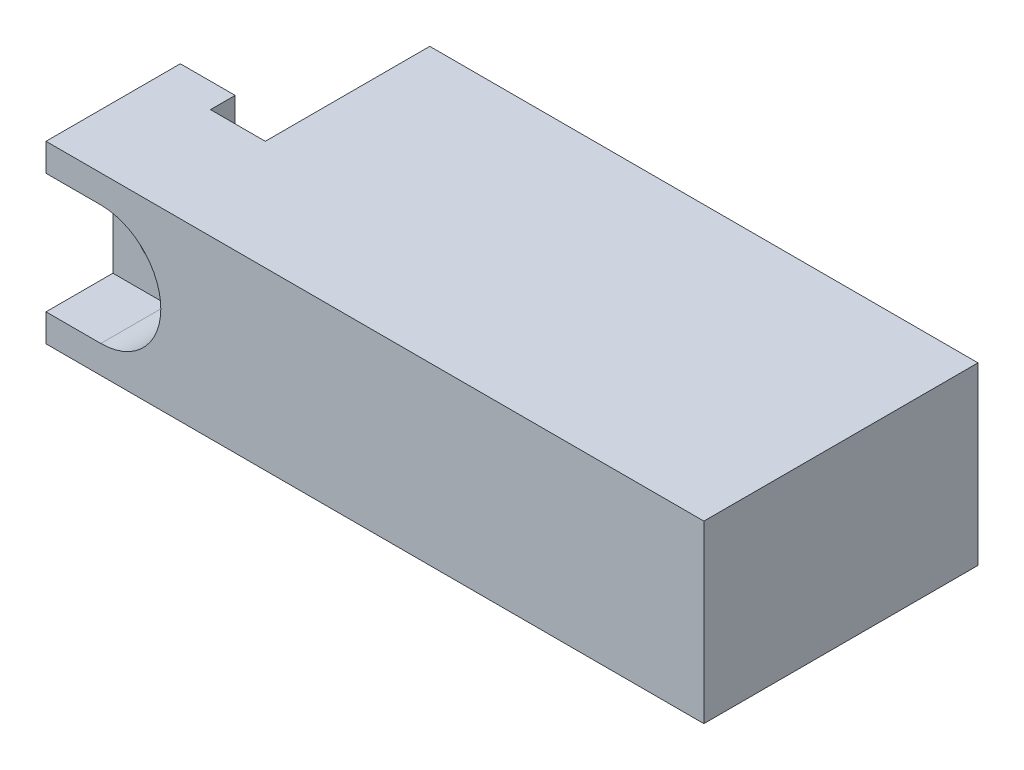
ISO-10303-21;
HEADER;
FILE_DESCRIPTION(('STEP AP214'),'2;1');
FILE_NAME('part.step','',(''),(''),'','','');
FILE_SCHEMA(('AUTOMOTIVE_DESIGN { 1 0 10303 214 1 1 1 1 }'));
ENDSEC;
DATA;
#1=APPLICATION_CONTEXT('core data for automotive mechanical design processes');
#2=APPLICATION_PROTOCOL_DEFINITION('international standard','automotive_design',2000,#1);
#3=PRODUCT_CONTEXT('',#1,'mechanical');
#4=PRODUCT('Part','Part','',(#3));
#5=PRODUCT_RELATED_PRODUCT_CATEGORY('part','',(#4));
#6=PRODUCT_DEFINITION_FORMATION('','',#4);
#7=PRODUCT_DEFINITION_CONTEXT('part definition',#1,'design');
#8=PRODUCT_DEFINITION('design','',#6,#7);
#9=PRODUCT_DEFINITION_SHAPE('','',#8);
#10=(LENGTH_UNIT() NAMED_UNIT(*) SI_UNIT(.MILLI.,.METRE.));
#11=(NAMED_UNIT(*) PLANE_ANGLE_UNIT() SI_UNIT($,.RADIAN.));
#12=(NAMED_UNIT(*) SI_UNIT($,.STERADIAN.) SOLID_ANGLE_UNIT());
#13=UNCERTAINTY_MEASURE_WITH_UNIT(LENGTH_MEASURE(1.E-05),#10,'distance_accuracy_value','');
#14=(GEOMETRIC_REPRESENTATION_CONTEXT(3) GLOBAL_UNCERTAINTY_ASSIGNED_CONTEXT((#13)) GLOBAL_UNIT_ASSIGNED_CONTEXT((#10,
#11,#12)) REPRESENTATION_CONTEXT('',''));
#15=CARTESIAN_POINT('',(0.,0.,0.));
#16=DIRECTION('',(0.,0.,1.));
#17=DIRECTION('',(1.,0.,0.));
#18=AXIS2_PLACEMENT_3D('',#15,#16,#17);
#19=CARTESIAN_POINT('',(-2.54,4.064,-6.35));
#20=DIRECTION('',(-1.,0.,0.));
#21=DIRECTION('',(0.,0.,1.));
#22=AXIS2_PLACEMENT_3D('',#19,#20,#21);
#23=PLANE('',#22);
#24=DIRECTION('',(0.,-1.,0.));
#25=VECTOR('',#24,1.);
#26=CARTESIAN_POINT('',(-2.54,-1.63195,-6.223));
#27=LINE('',#26,#25);
#28=CARTESIAN_POINT('',(-2.54,-1.63195,-6.223));
#29=VERTEX_POINT('',#28);
#30=CARTESIAN_POINT('',(-2.54,-4.064,-6.223));
#31=VERTEX_POINT('',#30);
#32=EDGE_CURVE('E258',#29,#31,#27,.T.);
#33=ORIENTED_EDGE('',*,*,#32,.F.);
#34=DIRECTION('',(0.,0.,1.));
#35=VECTOR('',#34,1.);
#36=CARTESIAN_POINT('',(-2.53999999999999,-1.63195,0.));
#37=LINE('',#36,#35);
#38=CARTESIAN_POINT('',(-2.54,-1.63195,-5.08));
#39=VERTEX_POINT('',#38);
#40=EDGE_CURVE('E199',#29,#39,#37,.T.);
#41=ORIENTED_EDGE('',*,*,#40,.T.);
#42=DIRECTION('',(0.,-1.,0.));
#43=VECTOR('',#42,1.);
#44=CARTESIAN_POINT('',(-2.54,4.064,-5.08));
#45=LINE('',#44,#43);
#46=CARTESIAN_POINT('',(-2.54,-4.064,-5.08));
#47=VERTEX_POINT('',#46);
#48=EDGE_CURVE('E156',#39,#47,#45,.T.);
#49=ORIENTED_EDGE('',*,*,#48,.T.);
#50=DIRECTION('',(0.,0.,-1.));
#51=VECTOR('',#50,1.);
#52=CARTESIAN_POINT('',(-2.54,-4.064,-6.35));
#53=LINE('',#52,#51);
#54=EDGE_CURVE('E178',#47,#31,#53,.T.);
#55=ORIENTED_EDGE('',*,*,#54,.T.);
#56=EDGE_LOOP('',(#33,#41,#49,#55));
#57=FACE_BOUND('',#56,.T.);
#58=ADVANCED_FACE('F37',(#57),#23,.F.);
#59=CARTESIAN_POINT('',(-5.08,4.064,-6.35));
#60=DIRECTION('',(1.,0.,0.));
#61=DIRECTION('',(0.,0.,-1.));
#62=AXIS2_PLACEMENT_3D('',#59,#60,#61);
#63=PLANE('',#62);
#64=DIRECTION('',(0.,1.,0.));
#65=VECTOR('',#64,1.);
#66=CARTESIAN_POINT('',(-5.08,-4.064,-6.223));
#67=LINE('',#66,#65);
#68=CARTESIAN_POINT('',(-5.08,-4.064,-6.223));
#69=VERTEX_POINT('',#68);
#70=CARTESIAN_POINT('',(-5.08,4.064,-6.223));
#71=VERTEX_POINT('',#70);
#72=EDGE_CURVE('E138',#69,#71,#67,.T.);
#73=ORIENTED_EDGE('',*,*,#72,.F.);
#74=DIRECTION('',(0.,0.,1.));
#75=VECTOR('',#74,1.);
#76=CARTESIAN_POINT('',(-5.08,-4.064,-6.35));
#77=LINE('',#76,#75);
#78=CARTESIAN_POINT('',(-5.08,-4.064,0.));
#79=VERTEX_POINT('',#78);
#80=EDGE_CURVE('E164',#69,#79,#77,.T.);
#81=ORIENTED_EDGE('',*,*,#80,.T.);
#82=DIRECTION('',(0.,-1.,0.));
#83=VECTOR('',#82,1.);
#84=CARTESIAN_POINT('',(-5.08,4.064,0.));
#85=LINE('',#84,#83);
#86=CARTESIAN_POINT('',(-5.08,-2.77876,0.));
#87=VERTEX_POINT('',#86);
#88=EDGE_CURVE('E194',#87,#79,#85,.T.);
#89=ORIENTED_EDGE('',*,*,#88,.F.);
#90=DIRECTION('',(0.,0.,1.));
#91=VECTOR('',#90,1.);
#92=CARTESIAN_POINT('',(-5.08,-2.77876,-9.20925240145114));
#93=LINE('',#92,#91);
#94=CARTESIAN_POINT('',(-5.08,-2.77876,-3.0988));
#95=VERTEX_POINT('',#94);
#96=EDGE_CURVE('E222',#95,#87,#93,.T.);
#97=ORIENTED_EDGE('',*,*,#96,.F.);
#98=DIRECTION('',(0.,1.,0.));
#99=VECTOR('',#98,1.);
#100=CARTESIAN_POINT('',(-5.08,4.064,-3.0988));
#101=LINE('',#100,#99);
#102=CARTESIAN_POINT('',(-5.08,2.77876,-3.0988));
#103=VERTEX_POINT('',#102);
#104=EDGE_CURVE('E11',#95,#103,#101,.T.);
#105=ORIENTED_EDGE('',*,*,#104,.T.);
#106=DIRECTION('',(0.,0.,1.));
#107=VECTOR('',#106,1.);
#108=CARTESIAN_POINT('',(-5.08,2.77876,-9.20925240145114));
#109=LINE('',#108,#107);
#110=CARTESIAN_POINT('',(-5.08,2.77876,0.));
#111=VERTEX_POINT('',#110);
#112=EDGE_CURVE('E227',#103,#111,#109,.T.);
#113=ORIENTED_EDGE('',*,*,#112,.T.);
#114=CARTESIAN_POINT('',(-5.08,4.064,0.));
#115=VERTEX_POINT('',#114);
#116=EDGE_CURVE('E195',#115,#111,#85,.T.);
#117=ORIENTED_EDGE('',*,*,#116,.F.);
#118=DIRECTION('',(0.,0.,1.));
#119=VECTOR('',#118,1.);
#120=CARTESIAN_POINT('',(-5.08,4.064,-6.35));
#121=LINE('',#120,#119);
#122=EDGE_CURVE('E180',#71,#115,#121,.T.);
#123=ORIENTED_EDGE('',*,*,#122,.F.);
#124=EDGE_LOOP('',(#73,#81,#89,#97,#105,#113,#117,#123));
#125=FACE_BOUND('',#124,.T.);
#126=ADVANCED_FACE('F39',(#125),#63,.F.);
#127=DIRECTION('',(0.,-1.,0.));
#128=VECTOR('',#127,1.);
#129=CARTESIAN_POINT('',(-2.54,4.064,-6.223));
#130=LINE('',#129,#128);
#131=CARTESIAN_POINT('',(-2.54,4.064,-6.223));
#132=VERTEX_POINT('',#131);
#133=CARTESIAN_POINT('',(-2.53999999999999,1.63195,-6.223));
#134=VERTEX_POINT('',#133);
#135=EDGE_CURVE('E52',#132,#134,#130,.T.);
#136=ORIENTED_EDGE('',*,*,#135,.F.);
#137=DIRECTION('',(0.,0.,-1.));
#138=VECTOR('',#137,1.);
#139=CARTESIAN_POINT('',(-2.54,4.064,-6.35));
#140=LINE('',#139,#138);
#141=CARTESIAN_POINT('',(-2.54,4.064,-5.08));
#142=VERTEX_POINT('',#141);
#143=EDGE_CURVE('E148',#142,#132,#140,.T.);
#144=ORIENTED_EDGE('',*,*,#143,.F.);
#145=CARTESIAN_POINT('',(-2.53999999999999,1.63195,-5.08));
#146=VERTEX_POINT('',#145);
#147=EDGE_CURVE('E158',#142,#146,#45,.T.);
#148=ORIENTED_EDGE('',*,*,#147,.T.);
#149=DIRECTION('',(0.,0.,1.));
#150=VECTOR('',#149,1.);
#151=CARTESIAN_POINT('',(-2.53999999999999,1.63195,0.));
#152=LINE('',#151,#150);
#153=EDGE_CURVE('E149',#146,#134,#152,.F.);
#154=ORIENTED_EDGE('',*,*,#153,.T.);
#155=EDGE_LOOP('',(#136,#144,#148,#154));
#156=FACE_BOUND('',#155,.T.);
#157=ADVANCED_FACE('F146',(#156),#23,.F.);
#158=CARTESIAN_POINT('',(-5.08,4.064,-6.35));
#159=DIRECTION('',(0.,-1.,0.));
#160=DIRECTION('',(0.,0.,-1.));
#161=AXIS2_PLACEMENT_3D('',#158,#159,#160);
#162=PLANE('',#161);
#163=DIRECTION('',(1.,0.,0.));
#164=VECTOR('',#163,1.);
#165=CARTESIAN_POINT('',(-5.08,4.064,-6.223));
#166=LINE('',#165,#164);
#167=EDGE_CURVE('E135',#71,#132,#166,.T.);
#168=ORIENTED_EDGE('',*,*,#167,.F.);
#169=ORIENTED_EDGE('',*,*,#122,.T.);
#170=DIRECTION('',(1.,0.,0.));
#171=VECTOR('',#170,1.);
#172=CARTESIAN_POINT('',(-5.08,4.064,0.));
#173=LINE('',#172,#171);
#174=CARTESIAN_POINT('',(25.4,4.064,0.));
#175=VERTEX_POINT('',#174);
#176=EDGE_CURVE('E237',#115,#175,#173,.T.);
#177=ORIENTED_EDGE('',*,*,#176,.T.);
#178=DIRECTION('',(0.,0.,-1.));
#179=VECTOR('',#178,1.);
#180=CARTESIAN_POINT('',(25.4,4.064,-12.7));
#181=LINE('',#180,#179);
#182=CARTESIAN_POINT('',(25.4,4.064,-12.7));
#183=VERTEX_POINT('',#182);
#184=EDGE_CURVE('E239',#175,#183,#181,.T.);
#185=ORIENTED_EDGE('',*,*,#184,.T.);
#186=DIRECTION('',(-1.,0.,0.));
#187=VECTOR('',#186,1.);
#188=CARTESIAN_POINT('',(0.,4.064,-12.7));
#189=LINE('',#188,#187);
#190=CARTESIAN_POINT('',(0.,4.064,-12.7));
#191=VERTEX_POINT('',#190);
#192=EDGE_CURVE('E241',#183,#191,#189,.T.);
#193=ORIENTED_EDGE('',*,*,#192,.T.);
#194=DIRECTION('',(0.,0.,1.));
#195=VECTOR('',#194,1.);
#196=CARTESIAN_POINT('',(0.,4.064,-5.08));
#197=LINE('',#196,#195);
#198=CARTESIAN_POINT('',(0.,4.064,-5.08));
#199=VERTEX_POINT('',#198);
#200=EDGE_CURVE('E160',#191,#199,#197,.T.);
#201=ORIENTED_EDGE('',*,*,#200,.T.);
#202=DIRECTION('',(-1.,0.,0.));
#203=VECTOR('',#202,1.);
#204=CARTESIAN_POINT('',(-2.54,4.064,-5.08));
#205=LINE('',#204,#203);
#206=EDGE_CURVE('E154',#199,#142,#205,.T.);
#207=ORIENTED_EDGE('',*,*,#206,.T.);
#208=ORIENTED_EDGE('',*,*,#143,.T.);
#209=EDGE_LOOP('',(#168,#169,#177,#185,#193,#201,#207,#208));
#210=FACE_BOUND('',#209,.T.);
#211=ADVANCED_FACE('F152',(#210),#162,.F.);
#212=CARTESIAN_POINT('',(-5.08,-4.064,-6.35));
#213=DIRECTION('',(0.,-1.,0.));
#214=DIRECTION('',(0.,0.,-1.));
#215=AXIS2_PLACEMENT_3D('',#212,#213,#214);
#216=PLANE('',#215);
#217=ORIENTED_EDGE('',*,*,#80,.F.);
#218=DIRECTION('',(-1.,0.,0.));
#219=VECTOR('',#218,1.);
#220=CARTESIAN_POINT('',(-2.54,-4.064,-6.223));
#221=LINE('',#220,#219);
#222=EDGE_CURVE('E260',#31,#69,#221,.T.);
#223=ORIENTED_EDGE('',*,*,#222,.F.);
#224=ORIENTED_EDGE('',*,*,#54,.F.);
#225=DIRECTION('',(-1.,0.,0.));
#226=VECTOR('',#225,1.);
#227=CARTESIAN_POINT('',(-2.54,-4.064,-5.08));
#228=LINE('',#227,#226);
#229=CARTESIAN_POINT('',(0.,-4.064,-5.08));
#230=VERTEX_POINT('',#229);
#231=EDGE_CURVE('E175',#230,#47,#228,.T.);
#232=ORIENTED_EDGE('',*,*,#231,.F.);
#233=DIRECTION('',(0.,0.,1.));
#234=VECTOR('',#233,1.);
#235=CARTESIAN_POINT('',(0.,-4.064,-5.08));
#236=LINE('',#235,#234);
#237=CARTESIAN_POINT('',(0.,-4.064,-12.7));
#238=VERTEX_POINT('',#237);
#239=EDGE_CURVE('E173',#238,#230,#236,.T.);
#240=ORIENTED_EDGE('',*,*,#239,.F.);
#241=DIRECTION('',(-1.,0.,0.));
#242=VECTOR('',#241,1.);
#243=CARTESIAN_POINT('',(0.,-4.064,-12.7));
#244=LINE('',#243,#242);
#245=CARTESIAN_POINT('',(25.4,-4.064,-12.7));
#246=VERTEX_POINT('',#245);
#247=EDGE_CURVE('E171',#246,#238,#244,.T.);
#248=ORIENTED_EDGE('',*,*,#247,.F.);
#249=DIRECTION('',(0.,0.,-1.));
#250=VECTOR('',#249,1.);
#251=CARTESIAN_POINT('',(25.4,-4.064,-12.7));
#252=LINE('',#251,#250);
#253=CARTESIAN_POINT('',(25.4,-4.064,0.));
#254=VERTEX_POINT('',#253);
#255=EDGE_CURVE('E169',#254,#246,#252,.T.);
#256=ORIENTED_EDGE('',*,*,#255,.F.);
#257=DIRECTION('',(1.,0.,0.));
#258=VECTOR('',#257,1.);
#259=CARTESIAN_POINT('',(-5.08,-4.064,0.));
#260=LINE('',#259,#258);
#261=EDGE_CURVE('E166',#79,#254,#260,.T.);
#262=ORIENTED_EDGE('',*,*,#261,.F.);
#263=EDGE_LOOP('',(#217,#223,#224,#232,#240,#248,#256,#262));
#264=FACE_BOUND('',#263,.T.);
#265=ADVANCED_FACE('F283',(#264),#216,.T.);
#266=CARTESIAN_POINT('',(-2.54,0.,0.));
#267=DIRECTION('',(0.,0.,1.));
#268=DIRECTION('',(1.,0.,0.));
#269=AXIS2_PLACEMENT_3D('',#266,#267,#268);
#270=CYLINDRICAL_SURFACE('',#269,1.63195);
#271=CARTESIAN_POINT('',(-2.54,0.,-3.0988));
#272=DIRECTION('',(0.,0.,1.));
#273=DIRECTION('',(1.,0.,0.));
#274=AXIS2_PLACEMENT_3D('',#271,#272,#273);
#275=CIRCLE('',#274,1.63195);
#276=CARTESIAN_POINT('',(-0.90805,0.,-3.0988));
#277=VERTEX_POINT('',#276);
#278=EDGE_CURVE('E220',#277,#277,#275,.T.);
#279=ORIENTED_EDGE('',*,*,#278,.T.);
#280=EDGE_LOOP('',(#279));
#281=FACE_BOUND('',#280,.T.);
#282=CARTESIAN_POINT('',(-2.54,0.,-6.223));
#283=DIRECTION('',(0.,0.,1.));
#284=DIRECTION('',(-1.,0.,0.));
#285=AXIS2_PLACEMENT_3D('',#282,#283,#284);
#286=CIRCLE('',#285,1.63195);
#287=EDGE_CURVE('E150',#134,#29,#286,.T.);
#288=ORIENTED_EDGE('',*,*,#287,.F.);
#289=ORIENTED_EDGE('',*,*,#153,.F.);
#290=CARTESIAN_POINT('',(-2.54,0.,-5.08));
#291=DIRECTION('',(0.,0.,1.));
#292=DIRECTION('',(1.,0.,0.));
#293=AXIS2_PLACEMENT_3D('',#290,#291,#292);
#294=CIRCLE('',#293,1.63195);
#295=EDGE_CURVE('E167',#39,#146,#294,.T.);
#296=ORIENTED_EDGE('',*,*,#295,.F.);
#297=ORIENTED_EDGE('',*,*,#40,.F.);
#298=EDGE_LOOP('',(#288,#289,#296,#297));
#299=FACE_BOUND('',#298,.T.);
#300=ADVANCED_FACE('F256',(#281,#299),#270,.F.);
#301=CARTESIAN_POINT('',(-5.08,4.064,0.));
#302=DIRECTION('',(0.,0.,-1.));
#303=DIRECTION('',(-1.,0.,0.));
#304=AXIS2_PLACEMENT_3D('',#301,#302,#303);
#305=PLANE('',#304);
#306=ORIENTED_EDGE('',*,*,#116,.T.);
#307=DIRECTION('',(-1.,0.,0.));
#308=VECTOR('',#307,1.);
#309=CARTESIAN_POINT('',(-2.54,2.77876,0.));
#310=LINE('',#309,#308);
#311=CARTESIAN_POINT('',(-2.54,2.77876,0.));
#312=VERTEX_POINT('',#311);
#313=EDGE_CURVE('E207',#312,#111,#310,.T.);
#314=ORIENTED_EDGE('',*,*,#313,.F.);
#315=CARTESIAN_POINT('',(-2.54,0.,0.));
#316=DIRECTION('',(0.,0.,-1.));
#317=DIRECTION('',(-1.,0.,0.));
#318=AXIS2_PLACEMENT_3D('',#315,#316,#317);
#319=CIRCLE('',#318,2.77876);
#320=CARTESIAN_POINT('',(-2.54,-2.77876,0.));
#321=VERTEX_POINT('',#320);
#322=EDGE_CURVE('E45',#312,#321,#319,.T.);
#323=ORIENTED_EDGE('',*,*,#322,.T.);
#324=DIRECTION('',(1.,0.,0.));
#325=VECTOR('',#324,1.);
#326=CARTESIAN_POINT('',(-2.54,-2.77876,0.));
#327=LINE('',#326,#325);
#328=EDGE_CURVE('E60',#87,#321,#327,.T.);
#329=ORIENTED_EDGE('',*,*,#328,.F.);
#330=ORIENTED_EDGE('',*,*,#88,.T.);
#331=ORIENTED_EDGE('',*,*,#261,.T.);
#332=DIRECTION('',(0.,-1.,0.));
#333=VECTOR('',#332,1.);
#334=CARTESIAN_POINT('',(25.4,4.064,0.));
#335=LINE('',#334,#333);
#336=EDGE_CURVE('E191',#175,#254,#335,.T.);
#337=ORIENTED_EDGE('',*,*,#336,.F.);
#338=ORIENTED_EDGE('',*,*,#176,.F.);
#339=EDGE_LOOP('',(#306,#314,#323,#329,#330,#331,#337,#338));
#340=FACE_BOUND('',#339,.T.);
#341=ADVANCED_FACE('F204',(#340),#305,.F.);
#342=CARTESIAN_POINT('',(25.4,4.064,-12.7));
#343=DIRECTION('',(-1.,0.,0.));
#344=DIRECTION('',(0.,0.,1.));
#345=AXIS2_PLACEMENT_3D('',#342,#343,#344);
#346=PLANE('',#345);
#347=ORIENTED_EDGE('',*,*,#255,.T.);
#348=DIRECTION('',(0.,-1.,0.));
#349=VECTOR('',#348,1.);
#350=CARTESIAN_POINT('',(25.4,4.064,-12.7));
#351=LINE('',#350,#349);
#352=EDGE_CURVE('E188',#183,#246,#351,.T.);
#353=ORIENTED_EDGE('',*,*,#352,.F.);
#354=ORIENTED_EDGE('',*,*,#184,.F.);
#355=ORIENTED_EDGE('',*,*,#336,.T.);
#356=EDGE_LOOP('',(#347,#353,#354,#355));
#357=FACE_BOUND('',#356,.T.);
#358=ADVANCED_FACE('F288',(#357),#346,.F.);
#359=CARTESIAN_POINT('',(0.,4.064,-12.7));
#360=DIRECTION('',(0.,0.,1.));
#361=DIRECTION('',(1.,0.,0.));
#362=AXIS2_PLACEMENT_3D('',#359,#360,#361);
#363=PLANE('',#362);
#364=ORIENTED_EDGE('',*,*,#247,.T.);
#365=DIRECTION('',(0.,-1.,0.));
#366=VECTOR('',#365,1.);
#367=CARTESIAN_POINT('',(0.,4.064,-12.7));
#368=LINE('',#367,#366);
#369=EDGE_CURVE('E185',#191,#238,#368,.T.);
#370=ORIENTED_EDGE('',*,*,#369,.F.);
#371=ORIENTED_EDGE('',*,*,#192,.F.);
#372=ORIENTED_EDGE('',*,*,#352,.T.);
#373=EDGE_LOOP('',(#364,#370,#371,#372));
#374=FACE_BOUND('',#373,.T.);
#375=ADVANCED_FACE('F290',(#374),#363,.F.);
#376=CARTESIAN_POINT('',(0.,4.064,-5.08));
#377=DIRECTION('',(1.,0.,0.));
#378=DIRECTION('',(0.,0.,-1.));
#379=AXIS2_PLACEMENT_3D('',#376,#377,#378);
#380=PLANE('',#379);
#381=ORIENTED_EDGE('',*,*,#239,.T.);
#382=DIRECTION('',(0.,-1.,0.));
#383=VECTOR('',#382,1.);
#384=CARTESIAN_POINT('',(0.,4.064,-5.08));
#385=LINE('',#384,#383);
#386=EDGE_CURVE('E182',#199,#230,#385,.T.);
#387=ORIENTED_EDGE('',*,*,#386,.F.);
#388=ORIENTED_EDGE('',*,*,#200,.F.);
#389=ORIENTED_EDGE('',*,*,#369,.T.);
#390=EDGE_LOOP('',(#381,#387,#388,#389));
#391=FACE_BOUND('',#390,.T.);
#392=ADVANCED_FACE('F247',(#391),#380,.F.);
#393=CARTESIAN_POINT('',(-2.54,4.064,-5.08));
#394=DIRECTION('',(0.,0.,1.));
#395=DIRECTION('',(1.,0.,0.));
#396=AXIS2_PLACEMENT_3D('',#393,#394,#395);
#397=PLANE('',#396);
#398=ORIENTED_EDGE('',*,*,#48,.F.);
#399=ORIENTED_EDGE('',*,*,#295,.T.);
#400=ORIENTED_EDGE('',*,*,#147,.F.);
#401=ORIENTED_EDGE('',*,*,#206,.F.);
#402=ORIENTED_EDGE('',*,*,#386,.T.);
#403=ORIENTED_EDGE('',*,*,#231,.T.);
#404=EDGE_LOOP('',(#398,#399,#400,#401,#402,#403));
#405=FACE_BOUND('',#404,.T.);
#406=ADVANCED_FACE('F252',(#405),#397,.F.);
#407=CARTESIAN_POINT('',(-0.90805,0.,-3.0988));
#408=DIRECTION('',(0.,0.,-1.));
#409=DIRECTION('',(-1.,0.,0.));
#410=AXIS2_PLACEMENT_3D('',#407,#408,#409);
#411=PLANE('',#410);
#412=ORIENTED_EDGE('',*,*,#278,.F.);
#413=EDGE_LOOP('',(#412));
#414=FACE_BOUND('',#413,.T.);
#415=CARTESIAN_POINT('',(-2.54,0.,-3.0988));
#416=DIRECTION('',(0.,0.,1.));
#417=DIRECTION('',(1.,0.,0.));
#418=AXIS2_PLACEMENT_3D('',#415,#416,#417);
#419=CIRCLE('',#418,2.77876);
#420=CARTESIAN_POINT('',(-2.54,-2.77876,-3.0988));
#421=VERTEX_POINT('',#420);
#422=CARTESIAN_POINT('',(-2.54,2.77876,-3.0988));
#423=VERTEX_POINT('',#422);
#424=EDGE_CURVE('E215',#421,#423,#419,.T.);
#425=ORIENTED_EDGE('',*,*,#424,.T.);
#426=DIRECTION('',(-1.,0.,0.));
#427=VECTOR('',#426,1.);
#428=CARTESIAN_POINT('',(-2.54,2.77876,-3.0988));
#429=LINE('',#428,#427);
#430=EDGE_CURVE('E229',#423,#103,#429,.T.);
#431=ORIENTED_EDGE('',*,*,#430,.T.);
#432=ORIENTED_EDGE('',*,*,#104,.F.);
#433=DIRECTION('',(1.,0.,0.));
#434=VECTOR('',#433,1.);
#435=CARTESIAN_POINT('',(-2.54,-2.77876,-3.0988));
#436=LINE('',#435,#434);
#437=EDGE_CURVE('E218',#95,#421,#436,.T.);
#438=ORIENTED_EDGE('',*,*,#437,.T.);
#439=EDGE_LOOP('',(#425,#431,#432,#438));
#440=FACE_BOUND('',#439,.T.);
#441=ADVANCED_FACE('F268',(#414,#440),#411,.F.);
#442=CARTESIAN_POINT('',(-2.54,0.,0.));
#443=DIRECTION('',(0.,0.,1.));
#444=DIRECTION('',(1.,0.,0.));
#445=AXIS2_PLACEMENT_3D('',#442,#443,#444);
#446=CYLINDRICAL_SURFACE('',#445,2.77876);
#447=ORIENTED_EDGE('',*,*,#322,.F.);
#448=DIRECTION('',(0.,0.,1.));
#449=VECTOR('',#448,1.);
#450=CARTESIAN_POINT('',(-2.54,2.77876,-9.20925240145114));
#451=LINE('',#450,#449);
#452=EDGE_CURVE('E212',#423,#312,#451,.T.);
#453=ORIENTED_EDGE('',*,*,#452,.F.);
#454=ORIENTED_EDGE('',*,*,#424,.F.);
#455=DIRECTION('',(0.,0.,1.));
#456=VECTOR('',#455,1.);
#457=CARTESIAN_POINT('',(-2.54,-2.77876,-9.20925240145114));
#458=LINE('',#457,#456);
#459=EDGE_CURVE('E214',#421,#321,#458,.T.);
#460=ORIENTED_EDGE('',*,*,#459,.T.);
#461=EDGE_LOOP('',(#447,#453,#454,#460));
#462=FACE_BOUND('',#461,.T.);
#463=ADVANCED_FACE('F210',(#462),#446,.F.);
#464=CARTESIAN_POINT('',(-2.54,-2.77876,-9.20925240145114));
#465=DIRECTION('',(0.,-1.,0.));
#466=DIRECTION('',(0.,0.,-1.));
#467=AXIS2_PLACEMENT_3D('',#464,#465,#466);
#468=PLANE('',#467);
#469=ORIENTED_EDGE('',*,*,#96,.T.);
#470=ORIENTED_EDGE('',*,*,#328,.T.);
#471=ORIENTED_EDGE('',*,*,#459,.F.);
#472=ORIENTED_EDGE('',*,*,#437,.F.);
#473=EDGE_LOOP('',(#469,#470,#471,#472));
#474=FACE_BOUND('',#473,.T.);
#475=ADVANCED_FACE('F310',(#474),#468,.F.);
#476=CARTESIAN_POINT('',(-2.54,2.77876,-9.20925240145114));
#477=DIRECTION('',(0.,1.,0.));
#478=DIRECTION('',(0.,0.,1.));
#479=AXIS2_PLACEMENT_3D('',#476,#477,#478);
#480=PLANE('',#479);
#481=ORIENTED_EDGE('',*,*,#452,.T.);
#482=ORIENTED_EDGE('',*,*,#313,.T.);
#483=ORIENTED_EDGE('',*,*,#112,.F.);
#484=ORIENTED_EDGE('',*,*,#430,.F.);
#485=EDGE_LOOP('',(#481,#482,#483,#484));
#486=FACE_BOUND('',#485,.T.);
#487=ADVANCED_FACE('F271',(#486),#480,.F.);
#488=CARTESIAN_POINT('',(-2.54,0.,-6.223));
#489=DIRECTION('',(0.,0.,-1.));
#490=DIRECTION('',(-1.,0.,0.));
#491=AXIS2_PLACEMENT_3D('',#488,#489,#490);
#492=PLANE('',#491);
#493=ORIENTED_EDGE('',*,*,#167,.T.);
#494=ORIENTED_EDGE('',*,*,#135,.T.);
#495=ORIENTED_EDGE('',*,*,#287,.T.);
#496=ORIENTED_EDGE('',*,*,#32,.T.);
#497=ORIENTED_EDGE('',*,*,#222,.T.);
#498=ORIENTED_EDGE('',*,*,#72,.T.);
#499=EDGE_LOOP('',(#493,#494,#495,#496,#497,#498));
#500=FACE_BOUND('',#499,.T.);
#501=ADVANCED_FACE('F136',(#500),#492,.T.);
#502=CLOSED_SHELL('',(#58,#126,#157,#211,#265,#300,#341,#358,#375,#392,#406,#441,#463,#475,#487,#501));
#503=MANIFOLD_SOLID_BREP('B2',#502);
#504=ADVANCED_BREP_SHAPE_REPRESENTATION('',(#18,#503),#14);
#505=SHAPE_DEFINITION_REPRESENTATION(#9,#504);
ENDSEC;
END-ISO-10303-21;
